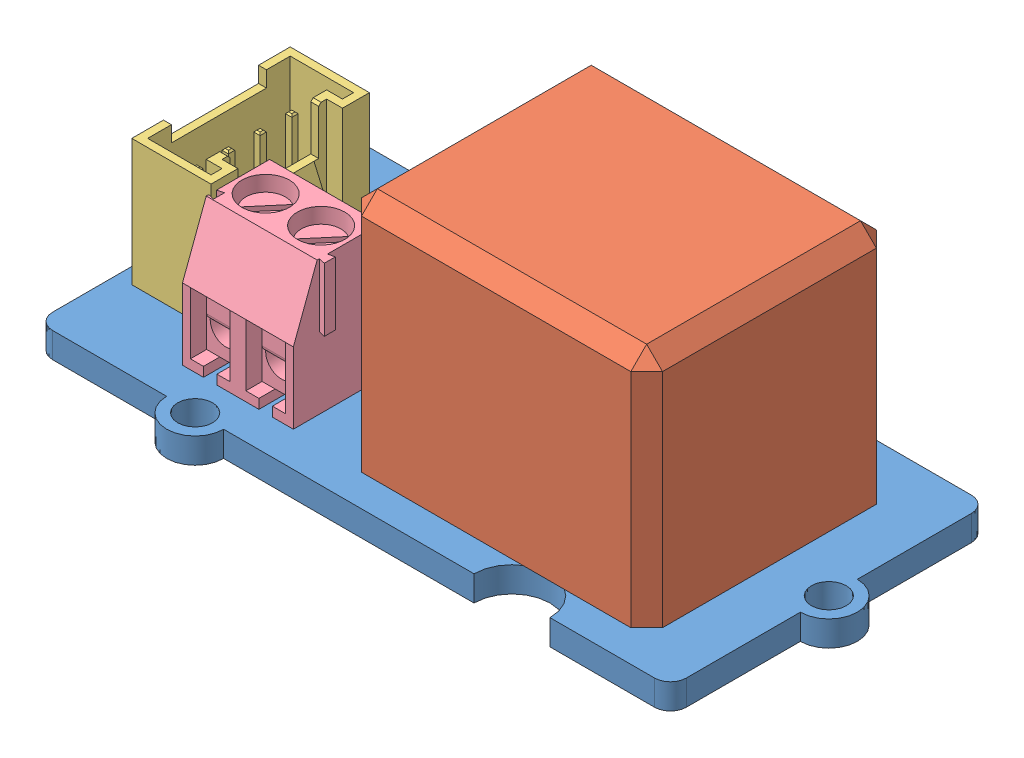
SolidWorks assembly Grove relay v1.2.SLDASM, configuration Défaut (file format 14000). Lengths in mm.
Overall size (41.8 18.5 23.6).
4 component instances, 4 part files, 9 mates.
Components (placement in the parent):
- PCB grove 20x40-1: PCB grove 20x40.SLDPRT [Défaut] at (4.6282 -3.7785 0) size (41.8 1.6 23.6)
- Relais HLS8L-DC3V-S-C-1: Relais HLS8L-DC3V-S-C.SLDPRT [Défaut] at (11.6282 -2.1785 0.25) x (-1 0 0) z (0 0 -1) size (19.55 18.5 15.5)
- Connecteur Grove (droit)-1: Connecteur Grove (droit).SLDPRT [Défaut] at (-9.3718 -2.1785 0) x (0 0 -1) z (1 0 0) size (10 11 5)
- Bornier 2ct-1: Bornier 2ct.SLDPRT [Défaut] at (-6.6218 -2.1785 4.3) size (7.8 11.38 7)
Mates (geometry in assembly coordinates):
- Coïncidente1: coincident aligned: plane of Relais HLS8L-DC3V-S-C-1 through (21.1282 -2.1785 -7.5) normal (0 -1 0); plane of Connecteur Grove (droit)-1 through (-9.3718 -2.1785 0) normal (0 -1 0)
- Coïncidente2: coincident aligned: plane of Connecteur Grove (droit)-1 through (-9.3718 -2.1785 0) normal (0 -1 0); plane of Bornier 2ct-1 through (-4.8718 -2.1785 7.8) normal (0 -1 0)
- Coïncidente3: coincident anti-aligned: plane of PCB grove 20x40-1 through (4.6282 -2.1785 0) normal (0 1 0); plane of Connecteur Grove (droit)-1 through (-9.3718 -2.1785 0) normal (0 -1 0)
- Distance4: distance = 2.2 mm aligned: plane of Bornier 2ct-1 through (-4.8718 2.3215 7.8) normal (0 0 1); plane of PCB grove 20x40-1 through (4.6282 -2.1785 10) normal (0 0 1)
- Distance5: distance = 2 mm: plane of Relais HLS8L-DC3V-S-C-1 through (11.6282 -2.1785 8) normal (0 0 1); line of PCB grove 20x40-1 through (17.0282 -2.1785 10) axis (1 0 0)
- Distance6: distance = 3.5 mm: plane of Relais HLS8L-DC3V-S-C-1 through (21.1282 12.8215 -7.5) normal (1 0 0); line of PCB grove 20x40-1 through (24.6282 -2.1785 9) axis (0 0 -1)
- Distance7: distance = 7 mm aligned: plane of Bornier 2ct-1 through (-8.3718 -2.1785 4.3) normal (-1 0 0); plane of PCB grove 20x40-1 through (-15.3718 -2.1785 0) normal (-1 0 0)
- Distance8: distance = 1 mm aligned: plane of PCB grove 20x40-1 through (-15.3718 -2.1785 0) normal (-1 0 0); plane of Connecteur Grove (droit)-1 through (-14.3718 5.8215 5) normal (-1 0 0)
- Distance9: distance = 5 mm aligned: plane of Connecteur Grove (droit)-1 through (-9.3718 5.8215 5) normal (0 0 1); plane of PCB grove 20x40-1 through (4.6282 -2.1785 10) normal (0 0 1)
